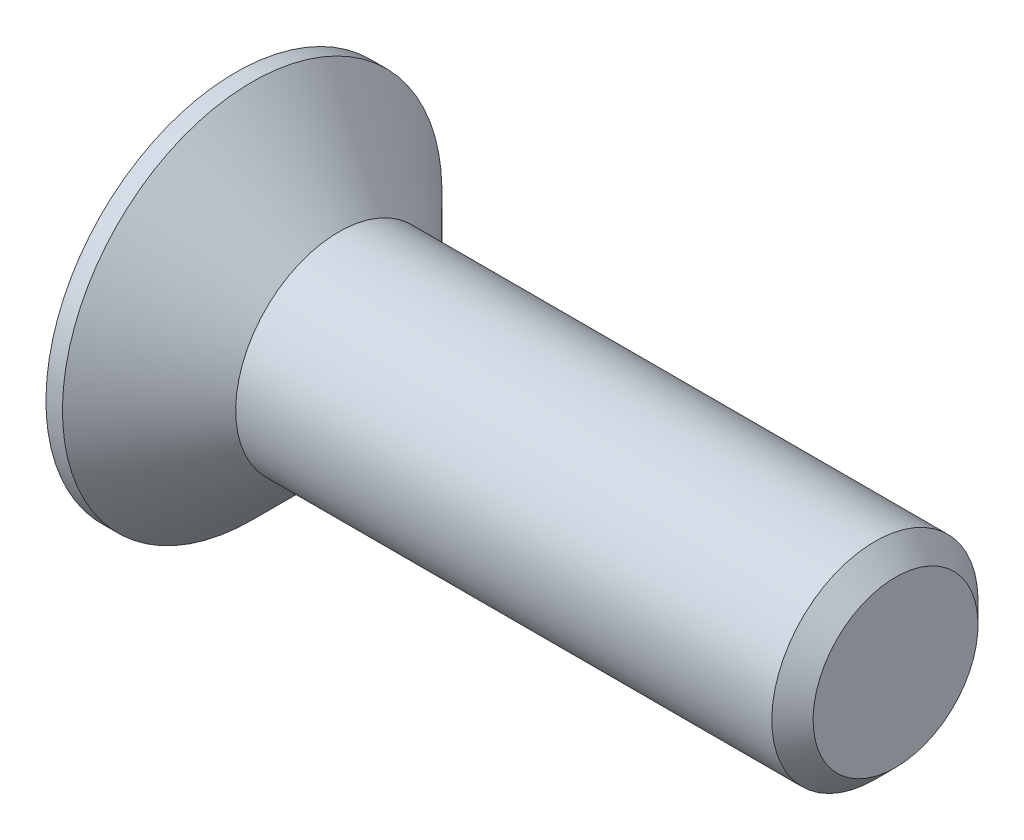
ISO-10303-21;
HEADER;
FILE_DESCRIPTION(('STEP AP214'),'2;1');
FILE_NAME('part.step','',(''),(''),'','','');
FILE_SCHEMA(('AUTOMOTIVE_DESIGN { 1 0 10303 214 1 1 1 1 }'));
ENDSEC;
DATA;
#1=APPLICATION_CONTEXT('core data for automotive mechanical design processes');
#2=APPLICATION_PROTOCOL_DEFINITION('international standard','automotive_design',2000,#1);
#3=PRODUCT_CONTEXT('',#1,'mechanical');
#4=PRODUCT('Part','Part','',(#3));
#5=PRODUCT_RELATED_PRODUCT_CATEGORY('part','',(#4));
#6=PRODUCT_DEFINITION_FORMATION('','',#4);
#7=PRODUCT_DEFINITION_CONTEXT('part definition',#1,'design');
#8=PRODUCT_DEFINITION('design','',#6,#7);
#9=PRODUCT_DEFINITION_SHAPE('','',#8);
#10=(LENGTH_UNIT() NAMED_UNIT(*) SI_UNIT(.MILLI.,.METRE.));
#11=(NAMED_UNIT(*) PLANE_ANGLE_UNIT() SI_UNIT($,.RADIAN.));
#12=(NAMED_UNIT(*) SI_UNIT($,.STERADIAN.) SOLID_ANGLE_UNIT());
#13=UNCERTAINTY_MEASURE_WITH_UNIT(LENGTH_MEASURE(1.E-05),#10,'distance_accuracy_value','');
#14=(GEOMETRIC_REPRESENTATION_CONTEXT(3) GLOBAL_UNCERTAINTY_ASSIGNED_CONTEXT((#13)) GLOBAL_UNIT_ASSIGNED_CONTEXT((#10,
#11,#12)) REPRESENTATION_CONTEXT('',''));
#15=CARTESIAN_POINT('',(0.,0.,0.));
#16=DIRECTION('',(0.,0.,1.));
#17=DIRECTION('',(1.,0.,0.));
#18=AXIS2_PLACEMENT_3D('',#15,#16,#17);
#19=CARTESIAN_POINT('',(0.,0.,0.));
#20=DIRECTION('',(-1.,0.,0.));
#21=DIRECTION('',(0.,-1.,0.));
#22=AXIS2_PLACEMENT_3D('',#19,#20,#21);
#23=CONICAL_SURFACE('',#22,2.5,0.78539816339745);
#24=CARTESIAN_POINT('',(-2.09999999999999,0.,0.));
#25=DIRECTION('',(-1.,0.,0.));
#26=DIRECTION('',(0.,-1.,0.));
#27=AXIS2_PLACEMENT_3D('',#24,#25,#26);
#28=CIRCLE('',#27,4.6);
#29=CARTESIAN_POINT('',(-2.09999999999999,-4.6,0.));
#30=VERTEX_POINT('',#29);
#31=EDGE_CURVE('E189',#30,#30,#28,.T.);
#32=ORIENTED_EDGE('',*,*,#31,.F.);
#33=EDGE_LOOP('',(#32));
#34=FACE_BOUND('',#33,.T.);
#35=CARTESIAN_POINT('',(0.,0.,0.));
#36=DIRECTION('',(-1.,0.,0.));
#37=DIRECTION('',(0.,-1.,0.));
#38=AXIS2_PLACEMENT_3D('',#35,#36,#37);
#39=CIRCLE('',#38,2.5);
#40=CARTESIAN_POINT('',(0.,-2.5,0.));
#41=VERTEX_POINT('',#40);
#42=EDGE_CURVE('E212',#41,#41,#39,.T.);
#43=ORIENTED_EDGE('',*,*,#42,.T.);
#44=EDGE_LOOP('',(#43));
#45=FACE_BOUND('',#44,.T.);
#46=ADVANCED_FACE('F33',(#34,#45),#23,.T.);
#47=CARTESIAN_POINT('',(-2.5,0.,0.));
#48=DIRECTION('',(-1.,0.,0.));
#49=DIRECTION('',(0.,-1.,0.));
#50=AXIS2_PLACEMENT_3D('',#47,#48,#49);
#51=CYLINDRICAL_SURFACE('',#50,2.5);
#52=CARTESIAN_POINT('',(13.,0.,0.));
#53=DIRECTION('',(-1.,0.,0.));
#54=DIRECTION('',(0.,-1.,0.));
#55=AXIS2_PLACEMENT_3D('',#52,#53,#54);
#56=CIRCLE('',#55,2.5);
#57=CARTESIAN_POINT('',(13.,-2.5,0.));
#58=VERTEX_POINT('',#57);
#59=EDGE_CURVE('E41',#58,#58,#56,.T.);
#60=ORIENTED_EDGE('',*,*,#59,.T.);
#61=EDGE_LOOP('',(#60));
#62=FACE_BOUND('',#61,.T.);
#63=ORIENTED_EDGE('',*,*,#42,.F.);
#64=EDGE_LOOP('',(#63));
#65=FACE_BOUND('',#64,.T.);
#66=ADVANCED_FACE('F217',(#62,#65),#51,.T.);
#67=CARTESIAN_POINT('',(13.5,0.,0.));
#68=DIRECTION('',(-1.,0.,0.));
#69=DIRECTION('',(0.,-1.,0.));
#70=AXIS2_PLACEMENT_3D('',#67,#68,#69);
#71=PLANE('',#70);
#72=CARTESIAN_POINT('',(13.5,0.,0.));
#73=DIRECTION('',(-1.,0.,0.));
#74=DIRECTION('',(0.,-1.,0.));
#75=AXIS2_PLACEMENT_3D('',#72,#73,#74);
#76=CIRCLE('',#75,1.99999999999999);
#77=CARTESIAN_POINT('',(13.5,-1.99999999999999,0.));
#78=VERTEX_POINT('',#77);
#79=EDGE_CURVE('E11',#78,#78,#76,.F.);
#80=ORIENTED_EDGE('',*,*,#79,.T.);
#81=EDGE_LOOP('',(#80));
#82=FACE_BOUND('',#81,.T.);
#83=ADVANCED_FACE('F239',(#82),#71,.F.);
#84=CARTESIAN_POINT('',(-2.5,4.6,0.));
#85=DIRECTION('',(1.,0.,0.));
#86=DIRECTION('',(0.,1.,0.));
#87=AXIS2_PLACEMENT_3D('',#84,#85,#86);
#88=PLANE('',#87);
#89=DIRECTION('',(0.,0.,-1.));
#90=VECTOR('',#89,1.);
#91=CARTESIAN_POINT('',(-2.5,0.575,-2.3));
#92=LINE('',#91,#90);
#93=CARTESIAN_POINT('',(-2.5,0.575,-0.575));
#94=VERTEX_POINT('',#93);
#95=CARTESIAN_POINT('',(-2.5,0.575,-2.3));
#96=VERTEX_POINT('',#95);
#97=EDGE_CURVE('E158',#94,#96,#92,.T.);
#98=ORIENTED_EDGE('',*,*,#97,.F.);
#99=DIRECTION('',(0.,-1.,0.));
#100=VECTOR('',#99,1.);
#101=CARTESIAN_POINT('',(-2.5,0.575,-0.575));
#102=LINE('',#101,#100);
#103=CARTESIAN_POINT('',(-2.5,2.3,-0.575));
#104=VERTEX_POINT('',#103);
#105=EDGE_CURVE('E48',#104,#94,#102,.T.);
#106=ORIENTED_EDGE('',*,*,#105,.F.);
#107=DIRECTION('',(0.,0.,-1.));
#108=VECTOR('',#107,1.);
#109=CARTESIAN_POINT('',(-2.5,2.3,-0.575));
#110=LINE('',#109,#108);
#111=CARTESIAN_POINT('',(-2.5,2.3,0.575));
#112=VERTEX_POINT('',#111);
#113=EDGE_CURVE('E185',#112,#104,#110,.T.);
#114=ORIENTED_EDGE('',*,*,#113,.F.);
#115=DIRECTION('',(0.,1.,0.));
#116=VECTOR('',#115,1.);
#117=CARTESIAN_POINT('',(-2.5,2.3,0.575));
#118=LINE('',#117,#116);
#119=CARTESIAN_POINT('',(-2.5,0.575,0.575));
#120=VERTEX_POINT('',#119);
#121=EDGE_CURVE('E183',#120,#112,#118,.T.);
#122=ORIENTED_EDGE('',*,*,#121,.F.);
#123=DIRECTION('',(0.,0.,-1.));
#124=VECTOR('',#123,1.);
#125=CARTESIAN_POINT('',(-2.5,0.575,0.575));
#126=LINE('',#125,#124);
#127=CARTESIAN_POINT('',(-2.5,0.575,2.3));
#128=VERTEX_POINT('',#127);
#129=EDGE_CURVE('E132',#128,#120,#126,.T.);
#130=ORIENTED_EDGE('',*,*,#129,.F.);
#131=DIRECTION('',(0.,1.,0.));
#132=VECTOR('',#131,1.);
#133=CARTESIAN_POINT('',(-2.5,0.575,2.3));
#134=LINE('',#133,#132);
#135=CARTESIAN_POINT('',(-2.5,-0.575,2.3));
#136=VERTEX_POINT('',#135);
#137=EDGE_CURVE('E179',#136,#128,#134,.T.);
#138=ORIENTED_EDGE('',*,*,#137,.F.);
#139=DIRECTION('',(0.,0.,1.));
#140=VECTOR('',#139,1.);
#141=CARTESIAN_POINT('',(-2.5,-0.575,2.3));
#142=LINE('',#141,#140);
#143=CARTESIAN_POINT('',(-2.5,-0.575,0.575));
#144=VERTEX_POINT('',#143);
#145=EDGE_CURVE('E176',#144,#136,#142,.T.);
#146=ORIENTED_EDGE('',*,*,#145,.F.);
#147=DIRECTION('',(0.,1.,0.));
#148=VECTOR('',#147,1.);
#149=CARTESIAN_POINT('',(-2.5,-0.575,0.575));
#150=LINE('',#149,#148);
#151=CARTESIAN_POINT('',(-2.5,-2.3,0.575));
#152=VERTEX_POINT('',#151);
#153=EDGE_CURVE('E173',#152,#144,#150,.T.);
#154=ORIENTED_EDGE('',*,*,#153,.F.);
#155=DIRECTION('',(0.,0.,1.));
#156=VECTOR('',#155,1.);
#157=CARTESIAN_POINT('',(-2.5,-2.3,0.575));
#158=LINE('',#157,#156);
#159=CARTESIAN_POINT('',(-2.5,-2.3,-0.575));
#160=VERTEX_POINT('',#159);
#161=EDGE_CURVE('E170',#160,#152,#158,.T.);
#162=ORIENTED_EDGE('',*,*,#161,.F.);
#163=DIRECTION('',(0.,-1.,0.));
#164=VECTOR('',#163,1.);
#165=CARTESIAN_POINT('',(-2.5,-2.3,-0.575));
#166=LINE('',#165,#164);
#167=CARTESIAN_POINT('',(-2.5,-0.575,-0.575));
#168=VERTEX_POINT('',#167);
#169=EDGE_CURVE('E167',#168,#160,#166,.T.);
#170=ORIENTED_EDGE('',*,*,#169,.F.);
#171=DIRECTION('',(0.,0.,1.));
#172=VECTOR('',#171,1.);
#173=CARTESIAN_POINT('',(-2.5,-0.575,-0.575));
#174=LINE('',#173,#172);
#175=CARTESIAN_POINT('',(-2.5,-0.575,-2.3));
#176=VERTEX_POINT('',#175);
#177=EDGE_CURVE('E164',#176,#168,#174,.T.);
#178=ORIENTED_EDGE('',*,*,#177,.F.);
#179=DIRECTION('',(0.,-1.,0.));
#180=VECTOR('',#179,1.);
#181=CARTESIAN_POINT('',(-2.5,-0.575,-2.3));
#182=LINE('',#181,#180);
#183=EDGE_CURVE('E161',#96,#176,#182,.T.);
#184=ORIENTED_EDGE('',*,*,#183,.F.);
#185=EDGE_LOOP('',(#98,#106,#114,#122,#130,#138,#146,#154,#162,#170,#178,#184));
#186=FACE_BOUND('',#185,.T.);
#187=CARTESIAN_POINT('',(-2.5,0.,0.));
#188=DIRECTION('',(-1.,0.,0.));
#189=DIRECTION('',(0.,-1.,0.));
#190=AXIS2_PLACEMENT_3D('',#187,#188,#189);
#191=CIRCLE('',#190,4.6);
#192=CARTESIAN_POINT('',(-2.5,-4.6,0.));
#193=VERTEX_POINT('',#192);
#194=EDGE_CURVE('E209',#193,#193,#191,.T.);
#195=ORIENTED_EDGE('',*,*,#194,.T.);
#196=EDGE_LOOP('',(#195));
#197=FACE_BOUND('',#196,.T.);
#198=ADVANCED_FACE('F230',(#186,#197),#88,.F.);
#199=CARTESIAN_POINT('',(-2.5,0.,0.));
#200=DIRECTION('',(-1.,0.,0.));
#201=DIRECTION('',(0.,-1.,0.));
#202=AXIS2_PLACEMENT_3D('',#199,#200,#201);
#203=CYLINDRICAL_SURFACE('',#202,4.6);
#204=ORIENTED_EDGE('',*,*,#194,.F.);
#205=EDGE_LOOP('',(#204));
#206=FACE_BOUND('',#205,.T.);
#207=ORIENTED_EDGE('',*,*,#31,.T.);
#208=EDGE_LOOP('',(#207));
#209=FACE_BOUND('',#208,.T.);
#210=ADVANCED_FACE('F222',(#206,#209),#203,.T.);
#211=CARTESIAN_POINT('',(13.,0.,0.));
#212=DIRECTION('',(-1.,0.,0.));
#213=DIRECTION('',(0.,-1.,0.));
#214=AXIS2_PLACEMENT_3D('',#211,#212,#213);
#215=CONICAL_SURFACE('',#214,2.5,0.785398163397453);
#216=ORIENTED_EDGE('',*,*,#79,.F.);
#217=EDGE_LOOP('',(#216));
#218=FACE_BOUND('',#217,.T.);
#219=ORIENTED_EDGE('',*,*,#59,.F.);
#220=EDGE_LOOP('',(#219));
#221=FACE_BOUND('',#220,.T.);
#222=ADVANCED_FACE('F35',(#218,#221),#215,.T.);
#223=CARTESIAN_POINT('',(-0.4,0.575,-0.575));
#224=DIRECTION('',(0.,0.,-1.));
#225=DIRECTION('',(-1.,0.,0.));
#226=AXIS2_PLACEMENT_3D('',#223,#224,#225);
#227=PLANE('',#226);
#228=ORIENTED_EDGE('',*,*,#105,.T.);
#229=DIRECTION('',(-1.,0.,0.));
#230=VECTOR('',#229,1.);
#231=CARTESIAN_POINT('',(-0.4,0.575,-0.575));
#232=LINE('',#231,#230);
#233=CARTESIAN_POINT('',(-0.4,0.575,-0.575));
#234=VERTEX_POINT('',#233);
#235=EDGE_CURVE('E96',#234,#94,#232,.T.);
#236=ORIENTED_EDGE('',*,*,#235,.F.);
#237=DIRECTION('',(0.,-1.,0.));
#238=VECTOR('',#237,1.);
#239=CARTESIAN_POINT('',(-0.4,0.575,-0.575));
#240=LINE('',#239,#238);
#241=CARTESIAN_POINT('',(-0.4,2.3,-0.575));
#242=VERTEX_POINT('',#241);
#243=EDGE_CURVE('E187',#242,#234,#240,.T.);
#244=ORIENTED_EDGE('',*,*,#243,.F.);
#245=DIRECTION('',(-1.,0.,0.));
#246=VECTOR('',#245,1.);
#247=CARTESIAN_POINT('',(-0.4,2.3,-0.575));
#248=LINE('',#247,#246);
#249=EDGE_CURVE('E56',#242,#104,#248,.T.);
#250=ORIENTED_EDGE('',*,*,#249,.T.);
#251=EDGE_LOOP('',(#228,#236,#244,#250));
#252=FACE_BOUND('',#251,.T.);
#253=ADVANCED_FACE('F221',(#252),#227,.F.);
#254=CARTESIAN_POINT('',(-0.4,2.3,-0.575));
#255=DIRECTION('',(0.,1.,0.));
#256=DIRECTION('',(-1.,0.,0.));
#257=AXIS2_PLACEMENT_3D('',#254,#255,#256);
#258=PLANE('',#257);
#259=ORIENTED_EDGE('',*,*,#113,.T.);
#260=ORIENTED_EDGE('',*,*,#249,.F.);
#261=DIRECTION('',(0.,0.,-1.));
#262=VECTOR('',#261,1.);
#263=CARTESIAN_POINT('',(-0.4,2.3,-0.575));
#264=LINE('',#263,#262);
#265=CARTESIAN_POINT('',(-0.4,2.3,0.575));
#266=VERTEX_POINT('',#265);
#267=EDGE_CURVE('E144',#266,#242,#264,.T.);
#268=ORIENTED_EDGE('',*,*,#267,.F.);
#269=DIRECTION('',(-1.,0.,0.));
#270=VECTOR('',#269,1.);
#271=CARTESIAN_POINT('',(-0.4,2.3,0.575));
#272=LINE('',#271,#270);
#273=EDGE_CURVE('E136',#266,#112,#272,.T.);
#274=ORIENTED_EDGE('',*,*,#273,.T.);
#275=EDGE_LOOP('',(#259,#260,#268,#274));
#276=FACE_BOUND('',#275,.T.);
#277=ADVANCED_FACE('F228',(#276),#258,.F.);
#278=CARTESIAN_POINT('',(-0.4,2.3,0.575));
#279=DIRECTION('',(0.,0.,1.));
#280=DIRECTION('',(1.,0.,0.));
#281=AXIS2_PLACEMENT_3D('',#278,#279,#280);
#282=PLANE('',#281);
#283=ORIENTED_EDGE('',*,*,#121,.T.);
#284=ORIENTED_EDGE('',*,*,#273,.F.);
#285=DIRECTION('',(0.,1.,0.));
#286=VECTOR('',#285,1.);
#287=CARTESIAN_POINT('',(-0.4,2.3,0.575));
#288=LINE('',#287,#286);
#289=CARTESIAN_POINT('',(-0.4,0.575,0.575));
#290=VERTEX_POINT('',#289);
#291=EDGE_CURVE('E140',#290,#266,#288,.T.);
#292=ORIENTED_EDGE('',*,*,#291,.F.);
#293=DIRECTION('',(-1.,0.,0.));
#294=VECTOR('',#293,1.);
#295=CARTESIAN_POINT('',(-0.4,0.575,0.575));
#296=LINE('',#295,#294);
#297=EDGE_CURVE('E125',#290,#120,#296,.T.);
#298=ORIENTED_EDGE('',*,*,#297,.T.);
#299=EDGE_LOOP('',(#283,#284,#292,#298));
#300=FACE_BOUND('',#299,.T.);
#301=ADVANCED_FACE('F141',(#300),#282,.F.);
#302=CARTESIAN_POINT('',(-0.4,0.575,0.575));
#303=DIRECTION('',(0.,1.,0.));
#304=DIRECTION('',(-1.,0.,0.));
#305=AXIS2_PLACEMENT_3D('',#302,#303,#304);
#306=PLANE('',#305);
#307=ORIENTED_EDGE('',*,*,#129,.T.);
#308=ORIENTED_EDGE('',*,*,#297,.F.);
#309=DIRECTION('',(0.,0.,-1.));
#310=VECTOR('',#309,1.);
#311=CARTESIAN_POINT('',(-0.4,0.575,0.575));
#312=LINE('',#311,#310);
#313=CARTESIAN_POINT('',(-0.4,0.575,2.3));
#314=VERTEX_POINT('',#313);
#315=EDGE_CURVE('E129',#314,#290,#312,.T.);
#316=ORIENTED_EDGE('',*,*,#315,.F.);
#317=DIRECTION('',(-1.,0.,0.));
#318=VECTOR('',#317,1.);
#319=CARTESIAN_POINT('',(-0.4,0.575,2.3));
#320=LINE('',#319,#318);
#321=EDGE_CURVE('E137',#314,#128,#320,.T.);
#322=ORIENTED_EDGE('',*,*,#321,.T.);
#323=EDGE_LOOP('',(#307,#308,#316,#322));
#324=FACE_BOUND('',#323,.T.);
#325=ADVANCED_FACE('F127',(#324),#306,.F.);
#326=CARTESIAN_POINT('',(-0.4,0.575,2.3));
#327=DIRECTION('',(0.,0.,1.));
#328=DIRECTION('',(1.,0.,0.));
#329=AXIS2_PLACEMENT_3D('',#326,#327,#328);
#330=PLANE('',#329);
#331=ORIENTED_EDGE('',*,*,#137,.T.);
#332=ORIENTED_EDGE('',*,*,#321,.F.);
#333=DIRECTION('',(0.,1.,0.));
#334=VECTOR('',#333,1.);
#335=CARTESIAN_POINT('',(-0.4,0.575,2.3));
#336=LINE('',#335,#334);
#337=CARTESIAN_POINT('',(-0.4,-0.575,2.3));
#338=VERTEX_POINT('',#337);
#339=EDGE_CURVE('E150',#338,#314,#336,.T.);
#340=ORIENTED_EDGE('',*,*,#339,.F.);
#341=DIRECTION('',(-1.,0.,0.));
#342=VECTOR('',#341,1.);
#343=CARTESIAN_POINT('',(-0.4,-0.575,2.3));
#344=LINE('',#343,#342);
#345=EDGE_CURVE('E192',#338,#136,#344,.T.);
#346=ORIENTED_EDGE('',*,*,#345,.T.);
#347=EDGE_LOOP('',(#331,#332,#340,#346));
#348=FACE_BOUND('',#347,.T.);
#349=ADVANCED_FACE('F277',(#348),#330,.F.);
#350=CARTESIAN_POINT('',(-0.4,-0.575,2.3));
#351=DIRECTION('',(0.,-1.,0.));
#352=DIRECTION('',(1.,0.,0.));
#353=AXIS2_PLACEMENT_3D('',#350,#351,#352);
#354=PLANE('',#353);
#355=ORIENTED_EDGE('',*,*,#145,.T.);
#356=ORIENTED_EDGE('',*,*,#345,.F.);
#357=DIRECTION('',(0.,0.,1.));
#358=VECTOR('',#357,1.);
#359=CARTESIAN_POINT('',(-0.4,-0.575,2.3));
#360=LINE('',#359,#358);
#361=CARTESIAN_POINT('',(-0.4,-0.575,0.575));
#362=VERTEX_POINT('',#361);
#363=EDGE_CURVE('E152',#362,#338,#360,.T.);
#364=ORIENTED_EDGE('',*,*,#363,.F.);
#365=DIRECTION('',(-1.,0.,0.));
#366=VECTOR('',#365,1.);
#367=CARTESIAN_POINT('',(-0.4,-0.575,0.575));
#368=LINE('',#367,#366);
#369=EDGE_CURVE('E194',#362,#144,#368,.T.);
#370=ORIENTED_EDGE('',*,*,#369,.T.);
#371=EDGE_LOOP('',(#355,#356,#364,#370));
#372=FACE_BOUND('',#371,.T.);
#373=ADVANCED_FACE('F273',(#372),#354,.F.);
#374=CARTESIAN_POINT('',(-0.4,-0.575,0.575));
#375=DIRECTION('',(0.,0.,1.));
#376=DIRECTION('',(1.,0.,0.));
#377=AXIS2_PLACEMENT_3D('',#374,#375,#376);
#378=PLANE('',#377);
#379=ORIENTED_EDGE('',*,*,#153,.T.);
#380=ORIENTED_EDGE('',*,*,#369,.F.);
#381=DIRECTION('',(0.,1.,0.));
#382=VECTOR('',#381,1.);
#383=CARTESIAN_POINT('',(-0.4,-0.575,0.575));
#384=LINE('',#383,#382);
#385=CARTESIAN_POINT('',(-0.4,-2.3,0.575));
#386=VERTEX_POINT('',#385);
#387=EDGE_CURVE('E422',#386,#362,#384,.T.);
#388=ORIENTED_EDGE('',*,*,#387,.F.);
#389=DIRECTION('',(-1.,0.,0.));
#390=VECTOR('',#389,1.);
#391=CARTESIAN_POINT('',(-0.4,-2.3,0.575));
#392=LINE('',#391,#390);
#393=EDGE_CURVE('E196',#386,#152,#392,.T.);
#394=ORIENTED_EDGE('',*,*,#393,.T.);
#395=EDGE_LOOP('',(#379,#380,#388,#394));
#396=FACE_BOUND('',#395,.T.);
#397=ADVANCED_FACE('F269',(#396),#378,.F.);
#398=CARTESIAN_POINT('',(-0.4,-2.3,0.575));
#399=DIRECTION('',(0.,-1.,0.));
#400=DIRECTION('',(1.,0.,0.));
#401=AXIS2_PLACEMENT_3D('',#398,#399,#400);
#402=PLANE('',#401);
#403=ORIENTED_EDGE('',*,*,#161,.T.);
#404=ORIENTED_EDGE('',*,*,#393,.F.);
#405=DIRECTION('',(0.,0.,1.));
#406=VECTOR('',#405,1.);
#407=CARTESIAN_POINT('',(-0.4,-2.3,0.575));
#408=LINE('',#407,#406);
#409=CARTESIAN_POINT('',(-0.4,-2.3,-0.575));
#410=VERTEX_POINT('',#409);
#411=EDGE_CURVE('E419',#410,#386,#408,.T.);
#412=ORIENTED_EDGE('',*,*,#411,.F.);
#413=DIRECTION('',(-1.,0.,0.));
#414=VECTOR('',#413,1.);
#415=CARTESIAN_POINT('',(-0.4,-2.3,-0.575));
#416=LINE('',#415,#414);
#417=EDGE_CURVE('E198',#410,#160,#416,.T.);
#418=ORIENTED_EDGE('',*,*,#417,.T.);
#419=EDGE_LOOP('',(#403,#404,#412,#418));
#420=FACE_BOUND('',#419,.T.);
#421=ADVANCED_FACE('F265',(#420),#402,.F.);
#422=CARTESIAN_POINT('',(-0.4,-2.3,-0.575));
#423=DIRECTION('',(0.,0.,-1.));
#424=DIRECTION('',(-1.,0.,0.));
#425=AXIS2_PLACEMENT_3D('',#422,#423,#424);
#426=PLANE('',#425);
#427=ORIENTED_EDGE('',*,*,#169,.T.);
#428=ORIENTED_EDGE('',*,*,#417,.F.);
#429=DIRECTION('',(0.,-1.,0.));
#430=VECTOR('',#429,1.);
#431=CARTESIAN_POINT('',(-0.4,-2.3,-0.575));
#432=LINE('',#431,#430);
#433=CARTESIAN_POINT('',(-0.4,-0.575,-0.575));
#434=VERTEX_POINT('',#433);
#435=EDGE_CURVE('E416',#434,#410,#432,.T.);
#436=ORIENTED_EDGE('',*,*,#435,.F.);
#437=DIRECTION('',(-1.,0.,0.));
#438=VECTOR('',#437,1.);
#439=CARTESIAN_POINT('',(-0.4,-0.575,-0.575));
#440=LINE('',#439,#438);
#441=EDGE_CURVE('E200',#434,#168,#440,.T.);
#442=ORIENTED_EDGE('',*,*,#441,.T.);
#443=EDGE_LOOP('',(#427,#428,#436,#442));
#444=FACE_BOUND('',#443,.T.);
#445=ADVANCED_FACE('F261',(#444),#426,.F.);
#446=CARTESIAN_POINT('',(-0.4,-0.575,-0.575));
#447=DIRECTION('',(0.,-1.,0.));
#448=DIRECTION('',(1.,0.,0.));
#449=AXIS2_PLACEMENT_3D('',#446,#447,#448);
#450=PLANE('',#449);
#451=ORIENTED_EDGE('',*,*,#177,.T.);
#452=ORIENTED_EDGE('',*,*,#441,.F.);
#453=DIRECTION('',(0.,0.,1.));
#454=VECTOR('',#453,1.);
#455=CARTESIAN_POINT('',(-0.4,-0.575,-0.575));
#456=LINE('',#455,#454);
#457=CARTESIAN_POINT('',(-0.4,-0.575,-2.3));
#458=VERTEX_POINT('',#457);
#459=EDGE_CURVE('E413',#458,#434,#456,.T.);
#460=ORIENTED_EDGE('',*,*,#459,.F.);
#461=DIRECTION('',(-1.,0.,0.));
#462=VECTOR('',#461,1.);
#463=CARTESIAN_POINT('',(-0.4,-0.575,-2.3));
#464=LINE('',#463,#462);
#465=EDGE_CURVE('E202',#458,#176,#464,.T.);
#466=ORIENTED_EDGE('',*,*,#465,.T.);
#467=EDGE_LOOP('',(#451,#452,#460,#466));
#468=FACE_BOUND('',#467,.T.);
#469=ADVANCED_FACE('F257',(#468),#450,.F.);
#470=CARTESIAN_POINT('',(-0.4,-0.575,-2.3));
#471=DIRECTION('',(0.,0.,-1.));
#472=DIRECTION('',(-1.,0.,0.));
#473=AXIS2_PLACEMENT_3D('',#470,#471,#472);
#474=PLANE('',#473);
#475=ORIENTED_EDGE('',*,*,#183,.T.);
#476=ORIENTED_EDGE('',*,*,#465,.F.);
#477=DIRECTION('',(0.,-1.,0.));
#478=VECTOR('',#477,1.);
#479=CARTESIAN_POINT('',(-0.4,-0.575,-2.3));
#480=LINE('',#479,#478);
#481=CARTESIAN_POINT('',(-0.4,0.575,-2.3));
#482=VERTEX_POINT('',#481);
#483=EDGE_CURVE('E408',#482,#458,#480,.T.);
#484=ORIENTED_EDGE('',*,*,#483,.F.);
#485=DIRECTION('',(-1.,0.,0.));
#486=VECTOR('',#485,1.);
#487=CARTESIAN_POINT('',(-0.4,0.575,-2.3));
#488=LINE('',#487,#486);
#489=EDGE_CURVE('E204',#482,#96,#488,.T.);
#490=ORIENTED_EDGE('',*,*,#489,.T.);
#491=EDGE_LOOP('',(#475,#476,#484,#490));
#492=FACE_BOUND('',#491,.T.);
#493=ADVANCED_FACE('F253',(#492),#474,.F.);
#494=CARTESIAN_POINT('',(-0.4,0.575,-2.3));
#495=DIRECTION('',(0.,1.,0.));
#496=DIRECTION('',(-1.,0.,0.));
#497=AXIS2_PLACEMENT_3D('',#494,#495,#496);
#498=PLANE('',#497);
#499=ORIENTED_EDGE('',*,*,#97,.T.);
#500=ORIENTED_EDGE('',*,*,#489,.F.);
#501=DIRECTION('',(0.,0.,-1.));
#502=VECTOR('',#501,1.);
#503=CARTESIAN_POINT('',(-0.4,0.575,-2.3));
#504=LINE('',#503,#502);
#505=EDGE_CURVE('E406',#234,#482,#504,.T.);
#506=ORIENTED_EDGE('',*,*,#505,.F.);
#507=ORIENTED_EDGE('',*,*,#235,.T.);
#508=EDGE_LOOP('',(#499,#500,#506,#507));
#509=FACE_BOUND('',#508,.T.);
#510=ADVANCED_FACE('F250',(#509),#498,.F.);
#511=CARTESIAN_POINT('',(-0.4,0.,0.));
#512=DIRECTION('',(1.,0.,0.));
#513=DIRECTION('',(0.,0.,-1.));
#514=AXIS2_PLACEMENT_3D('',#511,#512,#513);
#515=PLANE('',#514);
#516=ORIENTED_EDGE('',*,*,#243,.T.);
#517=ORIENTED_EDGE('',*,*,#505,.T.);
#518=ORIENTED_EDGE('',*,*,#483,.T.);
#519=ORIENTED_EDGE('',*,*,#459,.T.);
#520=ORIENTED_EDGE('',*,*,#435,.T.);
#521=ORIENTED_EDGE('',*,*,#411,.T.);
#522=ORIENTED_EDGE('',*,*,#387,.T.);
#523=ORIENTED_EDGE('',*,*,#363,.T.);
#524=ORIENTED_EDGE('',*,*,#339,.T.);
#525=ORIENTED_EDGE('',*,*,#315,.T.);
#526=ORIENTED_EDGE('',*,*,#291,.T.);
#527=ORIENTED_EDGE('',*,*,#267,.T.);
#528=EDGE_LOOP('',(#516,#517,#518,#519,#520,#521,#522,#523,#524,#525,#526,#527));
#529=FACE_BOUND('',#528,.T.);
#530=ADVANCED_FACE('F147',(#529),#515,.F.);
#531=CLOSED_SHELL('',(#46,#66,#83,#198,#210,#222,#253,#277,#301,#325,#349,#373,#397,#421,#445,
#469,#493,#510,#530));
#532=MANIFOLD_SOLID_BREP('B2',#531);
#533=ADVANCED_BREP_SHAPE_REPRESENTATION('',(#18,#532),#14);
#534=SHAPE_DEFINITION_REPRESENTATION(#9,#533);
ENDSEC;
END-ISO-10303-21;
